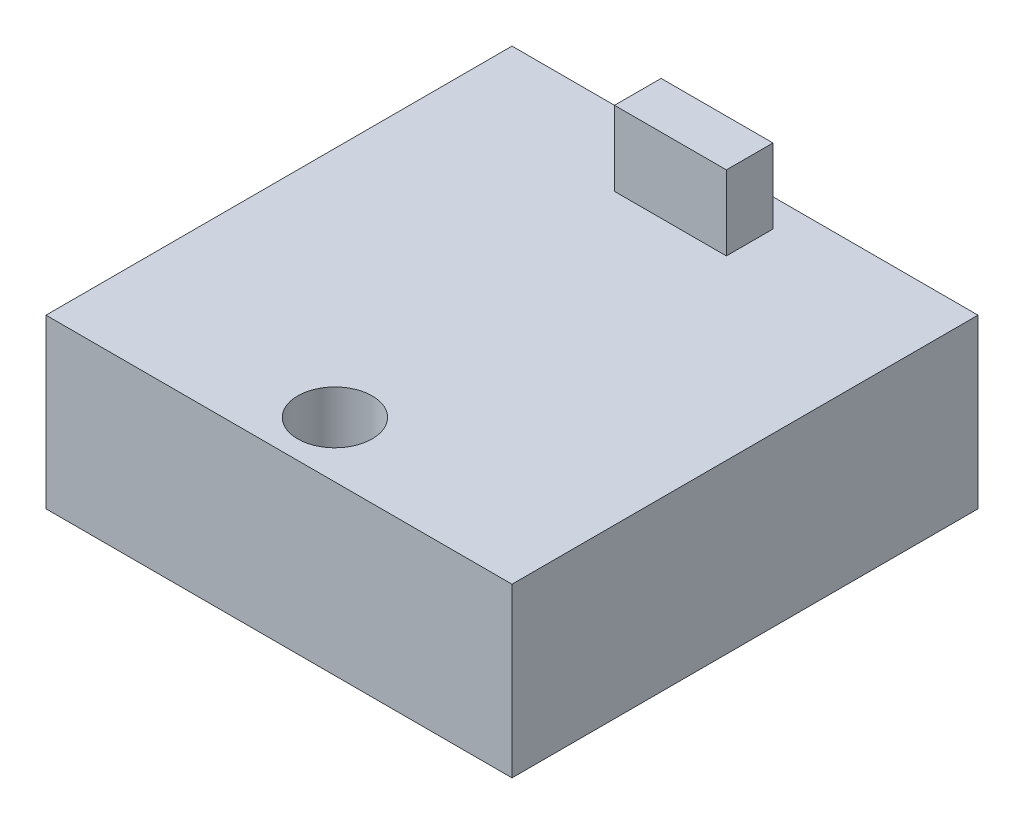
ISO-10303-21;
HEADER;
FILE_DESCRIPTION(('STEP AP214'),'2;1');
FILE_NAME('part.step','',(''),(''),'','','');
FILE_SCHEMA(('AUTOMOTIVE_DESIGN { 1 0 10303 214 1 1 1 1 }'));
ENDSEC;
DATA;
#1=APPLICATION_CONTEXT('core data for automotive mechanical design processes');
#2=APPLICATION_PROTOCOL_DEFINITION('international standard','automotive_design',2000,#1);
#3=PRODUCT_CONTEXT('',#1,'mechanical');
#4=PRODUCT('Part','Part','',(#3));
#5=PRODUCT_RELATED_PRODUCT_CATEGORY('part','',(#4));
#6=PRODUCT_DEFINITION_FORMATION('','',#4);
#7=PRODUCT_DEFINITION_CONTEXT('part definition',#1,'design');
#8=PRODUCT_DEFINITION('design','',#6,#7);
#9=PRODUCT_DEFINITION_SHAPE('','',#8);
#10=(LENGTH_UNIT() NAMED_UNIT(*) SI_UNIT(.MILLI.,.METRE.));
#11=(NAMED_UNIT(*) PLANE_ANGLE_UNIT() SI_UNIT($,.RADIAN.));
#12=(NAMED_UNIT(*) SI_UNIT($,.STERADIAN.) SOLID_ANGLE_UNIT());
#13=UNCERTAINTY_MEASURE_WITH_UNIT(LENGTH_MEASURE(1.E-05),#10,'distance_accuracy_value','');
#14=(GEOMETRIC_REPRESENTATION_CONTEXT(3) GLOBAL_UNCERTAINTY_ASSIGNED_CONTEXT((#13)) GLOBAL_UNIT_ASSIGNED_CONTEXT((#10,
#11,#12)) REPRESENTATION_CONTEXT('',''));
#15=CARTESIAN_POINT('',(0.,0.,0.));
#16=DIRECTION('',(0.,0.,1.));
#17=DIRECTION('',(1.,0.,0.));
#18=AXIS2_PLACEMENT_3D('',#15,#16,#17);
#19=CARTESIAN_POINT('',(0.,18.,0.));
#20=DIRECTION('',(0.,-1.,0.));
#21=DIRECTION('',(0.,0.,-1.));
#22=AXIS2_PLACEMENT_3D('',#19,#20,#21);
#23=PLANE('',#22);
#24=DIRECTION('',(0.,0.,1.));
#25=VECTOR('',#24,1.);
#26=CARTESIAN_POINT('',(0.,18.,0.));
#27=LINE('',#26,#25);
#28=CARTESIAN_POINT('',(0.,18.,-50.));
#29=VERTEX_POINT('',#28);
#30=CARTESIAN_POINT('',(0.,18.,0.));
#31=VERTEX_POINT('',#30);
#32=EDGE_CURVE('E130',#29,#31,#27,.T.);
#33=ORIENTED_EDGE('',*,*,#32,.T.);
#34=DIRECTION('',(1.,0.,0.));
#35=VECTOR('',#34,1.);
#36=CARTESIAN_POINT('',(0.,18.,0.));
#37=LINE('',#36,#35);
#38=CARTESIAN_POINT('',(50.,18.,0.));
#39=VERTEX_POINT('',#38);
#40=EDGE_CURVE('E133',#31,#39,#37,.T.);
#41=ORIENTED_EDGE('',*,*,#40,.T.);
#42=DIRECTION('',(0.,0.,-1.));
#43=VECTOR('',#42,1.);
#44=CARTESIAN_POINT('',(50.,18.,0.));
#45=LINE('',#44,#43);
#46=CARTESIAN_POINT('',(50.,18.,-50.));
#47=VERTEX_POINT('',#46);
#48=EDGE_CURVE('E136',#39,#47,#45,.T.);
#49=ORIENTED_EDGE('',*,*,#48,.T.);
#50=DIRECTION('',(-1.,0.,0.));
#51=VECTOR('',#50,1.);
#52=CARTESIAN_POINT('',(0.,18.,-50.));
#53=LINE('',#52,#51);
#54=EDGE_CURVE('E138',#47,#29,#53,.T.);
#55=ORIENTED_EDGE('',*,*,#54,.T.);
#56=EDGE_LOOP('',(#33,#41,#49,#55));
#57=FACE_BOUND('',#56,.T.);
#58=CARTESIAN_POINT('',(25.,18.,-6.));
#59=DIRECTION('',(0.,1.,0.));
#60=DIRECTION('',(0.,0.,1.));
#61=AXIS2_PLACEMENT_3D('',#58,#59,#60);
#62=CIRCLE('',#61,4.);
#63=CARTESIAN_POINT('',(25.,18.,-2.00000000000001));
#64=VERTEX_POINT('',#63);
#65=EDGE_CURVE('E118',#64,#64,#62,.T.);
#66=ORIENTED_EDGE('',*,*,#65,.F.);
#67=EDGE_LOOP('',(#66));
#68=FACE_BOUND('',#67,.T.);
#69=DIRECTION('',(0.,0.,1.));
#70=VECTOR('',#69,1.);
#71=CARTESIAN_POINT('',(19.,18.,-47.));
#72=LINE('',#71,#70);
#73=CARTESIAN_POINT('',(19.,18.,-47.));
#74=VERTEX_POINT('',#73);
#75=CARTESIAN_POINT('',(19.,18.,-42.));
#76=VERTEX_POINT('',#75);
#77=EDGE_CURVE('E117',#74,#76,#72,.T.);
#78=ORIENTED_EDGE('',*,*,#77,.F.);
#79=DIRECTION('',(-1.,0.,0.));
#80=VECTOR('',#79,1.);
#81=CARTESIAN_POINT('',(19.,18.,-47.));
#82=LINE('',#81,#80);
#83=CARTESIAN_POINT('',(31.,18.,-47.));
#84=VERTEX_POINT('',#83);
#85=EDGE_CURVE('E114',#84,#74,#82,.T.);
#86=ORIENTED_EDGE('',*,*,#85,.F.);
#87=DIRECTION('',(0.,0.,-1.));
#88=VECTOR('',#87,1.);
#89=CARTESIAN_POINT('',(31.,18.,-47.));
#90=LINE('',#89,#88);
#91=CARTESIAN_POINT('',(31.,18.,-42.));
#92=VERTEX_POINT('',#91);
#93=EDGE_CURVE('E52',#92,#84,#90,.T.);
#94=ORIENTED_EDGE('',*,*,#93,.F.);
#95=DIRECTION('',(1.,0.,0.));
#96=VECTOR('',#95,1.);
#97=CARTESIAN_POINT('',(19.,18.,-42.));
#98=LINE('',#97,#96);
#99=EDGE_CURVE('E47',#76,#92,#98,.T.);
#100=ORIENTED_EDGE('',*,*,#99,.F.);
#101=EDGE_LOOP('',(#78,#86,#94,#100));
#102=FACE_BOUND('',#101,.T.);
#103=ADVANCED_FACE('F32',(#57,#68,#102),#23,.F.);
#104=CARTESIAN_POINT('',(0.,18.,0.));
#105=DIRECTION('',(1.,0.,0.));
#106=DIRECTION('',(0.,0.,-1.));
#107=AXIS2_PLACEMENT_3D('',#104,#105,#106);
#108=PLANE('',#107);
#109=DIRECTION('',(0.,0.,1.));
#110=VECTOR('',#109,1.);
#111=CARTESIAN_POINT('',(0.,0.,0.));
#112=LINE('',#111,#110);
#113=CARTESIAN_POINT('',(0.,0.,-50.));
#114=VERTEX_POINT('',#113);
#115=CARTESIAN_POINT('',(0.,0.,0.));
#116=VERTEX_POINT('',#115);
#117=EDGE_CURVE('E128',#114,#116,#112,.T.);
#118=ORIENTED_EDGE('',*,*,#117,.T.);
#119=DIRECTION('',(0.,-1.,0.));
#120=VECTOR('',#119,1.);
#121=CARTESIAN_POINT('',(0.,18.,0.));
#122=LINE('',#121,#120);
#123=EDGE_CURVE('E11',#31,#116,#122,.T.);
#124=ORIENTED_EDGE('',*,*,#123,.F.);
#125=ORIENTED_EDGE('',*,*,#32,.F.);
#126=DIRECTION('',(0.,-1.,0.));
#127=VECTOR('',#126,1.);
#128=CARTESIAN_POINT('',(0.,18.,-50.));
#129=LINE('',#128,#127);
#130=EDGE_CURVE('E140',#29,#114,#129,.T.);
#131=ORIENTED_EDGE('',*,*,#130,.T.);
#132=EDGE_LOOP('',(#118,#124,#125,#131));
#133=FACE_BOUND('',#132,.T.);
#134=ADVANCED_FACE('F34',(#133),#108,.F.);
#135=CARTESIAN_POINT('',(0.,18.,0.));
#136=DIRECTION('',(0.,0.,-1.));
#137=DIRECTION('',(-1.,0.,0.));
#138=AXIS2_PLACEMENT_3D('',#135,#136,#137);
#139=PLANE('',#138);
#140=DIRECTION('',(1.,0.,0.));
#141=VECTOR('',#140,1.);
#142=CARTESIAN_POINT('',(0.,0.,0.));
#143=LINE('',#142,#141);
#144=CARTESIAN_POINT('',(50.,0.,0.));
#145=VERTEX_POINT('',#144);
#146=EDGE_CURVE('E143',#116,#145,#143,.T.);
#147=ORIENTED_EDGE('',*,*,#146,.T.);
#148=DIRECTION('',(0.,-1.,0.));
#149=VECTOR('',#148,1.);
#150=CARTESIAN_POINT('',(50.,18.,0.));
#151=LINE('',#150,#149);
#152=EDGE_CURVE('E40',#39,#145,#151,.T.);
#153=ORIENTED_EDGE('',*,*,#152,.F.);
#154=ORIENTED_EDGE('',*,*,#40,.F.);
#155=ORIENTED_EDGE('',*,*,#123,.T.);
#156=EDGE_LOOP('',(#147,#153,#154,#155));
#157=FACE_BOUND('',#156,.T.);
#158=ADVANCED_FACE('F173',(#157),#139,.F.);
#159=CARTESIAN_POINT('',(50.,18.,0.));
#160=DIRECTION('',(-1.,0.,0.));
#161=DIRECTION('',(0.,0.,1.));
#162=AXIS2_PLACEMENT_3D('',#159,#160,#161);
#163=PLANE('',#162);
#164=DIRECTION('',(0.,0.,-1.));
#165=VECTOR('',#164,1.);
#166=CARTESIAN_POINT('',(50.,0.,0.));
#167=LINE('',#166,#165);
#168=CARTESIAN_POINT('',(50.,0.,-50.));
#169=VERTEX_POINT('',#168);
#170=EDGE_CURVE('E145',#145,#169,#167,.T.);
#171=ORIENTED_EDGE('',*,*,#170,.T.);
#172=DIRECTION('',(0.,-1.,0.));
#173=VECTOR('',#172,1.);
#174=CARTESIAN_POINT('',(50.,18.,-50.));
#175=LINE('',#174,#173);
#176=EDGE_CURVE('E150',#47,#169,#175,.T.);
#177=ORIENTED_EDGE('',*,*,#176,.F.);
#178=ORIENTED_EDGE('',*,*,#48,.F.);
#179=ORIENTED_EDGE('',*,*,#152,.T.);
#180=EDGE_LOOP('',(#171,#177,#178,#179));
#181=FACE_BOUND('',#180,.T.);
#182=ADVANCED_FACE('F157',(#181),#163,.F.);
#183=CARTESIAN_POINT('',(0.,18.,-50.));
#184=DIRECTION('',(0.,0.,1.));
#185=DIRECTION('',(1.,0.,0.));
#186=AXIS2_PLACEMENT_3D('',#183,#184,#185);
#187=PLANE('',#186);
#188=DIRECTION('',(-1.,0.,0.));
#189=VECTOR('',#188,1.);
#190=CARTESIAN_POINT('',(0.,0.,-50.));
#191=LINE('',#190,#189);
#192=EDGE_CURVE('E134',#169,#114,#191,.T.);
#193=ORIENTED_EDGE('',*,*,#192,.T.);
#194=ORIENTED_EDGE('',*,*,#130,.F.);
#195=ORIENTED_EDGE('',*,*,#54,.F.);
#196=ORIENTED_EDGE('',*,*,#176,.T.);
#197=EDGE_LOOP('',(#193,#194,#195,#196));
#198=FACE_BOUND('',#197,.T.);
#199=ADVANCED_FACE('F166',(#198),#187,.F.);
#200=CARTESIAN_POINT('',(0.,0.,0.));
#201=DIRECTION('',(0.,-1.,0.));
#202=DIRECTION('',(0.,0.,-1.));
#203=AXIS2_PLACEMENT_3D('',#200,#201,#202);
#204=PLANE('',#203);
#205=ORIENTED_EDGE('',*,*,#117,.F.);
#206=ORIENTED_EDGE('',*,*,#192,.F.);
#207=ORIENTED_EDGE('',*,*,#170,.F.);
#208=ORIENTED_EDGE('',*,*,#146,.F.);
#209=EDGE_LOOP('',(#205,#206,#207,#208));
#210=FACE_BOUND('',#209,.T.);
#211=ADVANCED_FACE('F163',(#210),#204,.T.);
#212=CARTESIAN_POINT('',(25.,10.,-6.));
#213=DIRECTION('',(0.,1.,0.));
#214=DIRECTION('',(0.,0.,1.));
#215=AXIS2_PLACEMENT_3D('',#212,#213,#214);
#216=CYLINDRICAL_SURFACE('',#215,4.);
#217=CARTESIAN_POINT('',(25.,10.,-6.));
#218=DIRECTION('',(0.,1.,0.));
#219=DIRECTION('',(0.,0.,1.));
#220=AXIS2_PLACEMENT_3D('',#217,#218,#219);
#221=CIRCLE('',#220,4.);
#222=CARTESIAN_POINT('',(25.,10.,-2.00000000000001));
#223=VERTEX_POINT('',#222);
#224=EDGE_CURVE('E121',#223,#223,#221,.T.);
#225=ORIENTED_EDGE('',*,*,#224,.F.);
#226=EDGE_LOOP('',(#225));
#227=FACE_BOUND('',#226,.T.);
#228=ORIENTED_EDGE('',*,*,#65,.T.);
#229=EDGE_LOOP('',(#228));
#230=FACE_BOUND('',#229,.T.);
#231=ADVANCED_FACE('F186',(#227,#230),#216,.F.);
#232=CARTESIAN_POINT('',(25.,10.,-6.));
#233=DIRECTION('',(0.,1.,0.));
#234=DIRECTION('',(0.,0.,1.));
#235=AXIS2_PLACEMENT_3D('',#232,#233,#234);
#236=PLANE('',#235);
#237=ORIENTED_EDGE('',*,*,#224,.T.);
#238=EDGE_LOOP('',(#237));
#239=FACE_BOUND('',#238,.T.);
#240=ADVANCED_FACE('F205',(#239),#236,.T.);
#241=CARTESIAN_POINT('',(19.,26.,-47.));
#242=DIRECTION('',(1.,0.,0.));
#243=DIRECTION('',(0.,0.,-1.));
#244=AXIS2_PLACEMENT_3D('',#241,#242,#243);
#245=PLANE('',#244);
#246=ORIENTED_EDGE('',*,*,#77,.T.);
#247=DIRECTION('',(0.,-1.,0.));
#248=VECTOR('',#247,1.);
#249=CARTESIAN_POINT('',(19.,26.,-42.));
#250=LINE('',#249,#248);
#251=CARTESIAN_POINT('',(19.,26.,-42.));
#252=VERTEX_POINT('',#251);
#253=EDGE_CURVE('E98',#252,#76,#250,.T.);
#254=ORIENTED_EDGE('',*,*,#253,.F.);
#255=DIRECTION('',(0.,0.,1.));
#256=VECTOR('',#255,1.);
#257=CARTESIAN_POINT('',(19.,26.,-47.));
#258=LINE('',#257,#256);
#259=CARTESIAN_POINT('',(19.,26.,-47.));
#260=VERTEX_POINT('',#259);
#261=EDGE_CURVE('E105',#260,#252,#258,.T.);
#262=ORIENTED_EDGE('',*,*,#261,.F.);
#263=DIRECTION('',(0.,-1.,0.));
#264=VECTOR('',#263,1.);
#265=CARTESIAN_POINT('',(19.,26.,-47.));
#266=LINE('',#265,#264);
#267=EDGE_CURVE('E286',#260,#74,#266,.T.);
#268=ORIENTED_EDGE('',*,*,#267,.T.);
#269=EDGE_LOOP('',(#246,#254,#262,#268));
#270=FACE_BOUND('',#269,.T.);
#271=ADVANCED_FACE('F116',(#270),#245,.F.);
#272=CARTESIAN_POINT('',(19.,26.,-42.));
#273=DIRECTION('',(0.,0.,-1.));
#274=DIRECTION('',(-1.,0.,0.));
#275=AXIS2_PLACEMENT_3D('',#272,#273,#274);
#276=PLANE('',#275);
#277=ORIENTED_EDGE('',*,*,#99,.T.);
#278=DIRECTION('',(0.,-1.,0.));
#279=VECTOR('',#278,1.);
#280=CARTESIAN_POINT('',(31.,26.,-42.));
#281=LINE('',#280,#279);
#282=CARTESIAN_POINT('',(31.,26.,-42.));
#283=VERTEX_POINT('',#282);
#284=EDGE_CURVE('E101',#283,#92,#281,.T.);
#285=ORIENTED_EDGE('',*,*,#284,.F.);
#286=DIRECTION('',(1.,0.,0.));
#287=VECTOR('',#286,1.);
#288=CARTESIAN_POINT('',(19.,26.,-42.));
#289=LINE('',#288,#287);
#290=EDGE_CURVE('E94',#252,#283,#289,.T.);
#291=ORIENTED_EDGE('',*,*,#290,.F.);
#292=ORIENTED_EDGE('',*,*,#253,.T.);
#293=EDGE_LOOP('',(#277,#285,#291,#292));
#294=FACE_BOUND('',#293,.T.);
#295=ADVANCED_FACE('F96',(#294),#276,.F.);
#296=CARTESIAN_POINT('',(31.,26.,-47.));
#297=DIRECTION('',(-1.,0.,0.));
#298=DIRECTION('',(0.,0.,1.));
#299=AXIS2_PLACEMENT_3D('',#296,#297,#298);
#300=PLANE('',#299);
#301=ORIENTED_EDGE('',*,*,#93,.T.);
#302=DIRECTION('',(0.,-1.,0.));
#303=VECTOR('',#302,1.);
#304=CARTESIAN_POINT('',(31.,26.,-47.));
#305=LINE('',#304,#303);
#306=CARTESIAN_POINT('',(31.,26.,-47.));
#307=VERTEX_POINT('',#306);
#308=EDGE_CURVE('E123',#307,#84,#305,.T.);
#309=ORIENTED_EDGE('',*,*,#308,.F.);
#310=DIRECTION('',(0.,0.,-1.));
#311=VECTOR('',#310,1.);
#312=CARTESIAN_POINT('',(31.,26.,-47.));
#313=LINE('',#312,#311);
#314=EDGE_CURVE('E104',#283,#307,#313,.T.);
#315=ORIENTED_EDGE('',*,*,#314,.F.);
#316=ORIENTED_EDGE('',*,*,#284,.T.);
#317=EDGE_LOOP('',(#301,#309,#315,#316));
#318=FACE_BOUND('',#317,.T.);
#319=ADVANCED_FACE('F224',(#318),#300,.F.);
#320=CARTESIAN_POINT('',(19.,26.,-47.));
#321=DIRECTION('',(0.,0.,1.));
#322=DIRECTION('',(1.,0.,0.));
#323=AXIS2_PLACEMENT_3D('',#320,#321,#322);
#324=PLANE('',#323);
#325=ORIENTED_EDGE('',*,*,#85,.T.);
#326=ORIENTED_EDGE('',*,*,#267,.F.);
#327=DIRECTION('',(-1.,0.,0.));
#328=VECTOR('',#327,1.);
#329=CARTESIAN_POINT('',(19.,26.,-47.));
#330=LINE('',#329,#328);
#331=EDGE_CURVE('E110',#307,#260,#330,.T.);
#332=ORIENTED_EDGE('',*,*,#331,.F.);
#333=ORIENTED_EDGE('',*,*,#308,.T.);
#334=EDGE_LOOP('',(#325,#326,#332,#333));
#335=FACE_BOUND('',#334,.T.);
#336=ADVANCED_FACE('F231',(#335),#324,.F.);
#337=CARTESIAN_POINT('',(0.,26.,0.));
#338=DIRECTION('',(0.,1.,0.));
#339=DIRECTION('',(0.,0.,1.));
#340=AXIS2_PLACEMENT_3D('',#337,#338,#339);
#341=PLANE('',#340);
#342=ORIENTED_EDGE('',*,*,#261,.T.);
#343=ORIENTED_EDGE('',*,*,#290,.T.);
#344=ORIENTED_EDGE('',*,*,#314,.T.);
#345=ORIENTED_EDGE('',*,*,#331,.T.);
#346=EDGE_LOOP('',(#342,#343,#344,#345));
#347=FACE_BOUND('',#346,.T.);
#348=ADVANCED_FACE('F108',(#347),#341,.T.);
#349=CLOSED_SHELL('',(#103,#134,#158,#182,#199,#211,#231,#240,#271,#295,#319,#336,#348));
#350=MANIFOLD_SOLID_BREP('B2',#349);
#351=ADVANCED_BREP_SHAPE_REPRESENTATION('',(#18,#350),#14);
#352=SHAPE_DEFINITION_REPRESENTATION(#9,#351);
ENDSEC;
END-ISO-10303-21;
